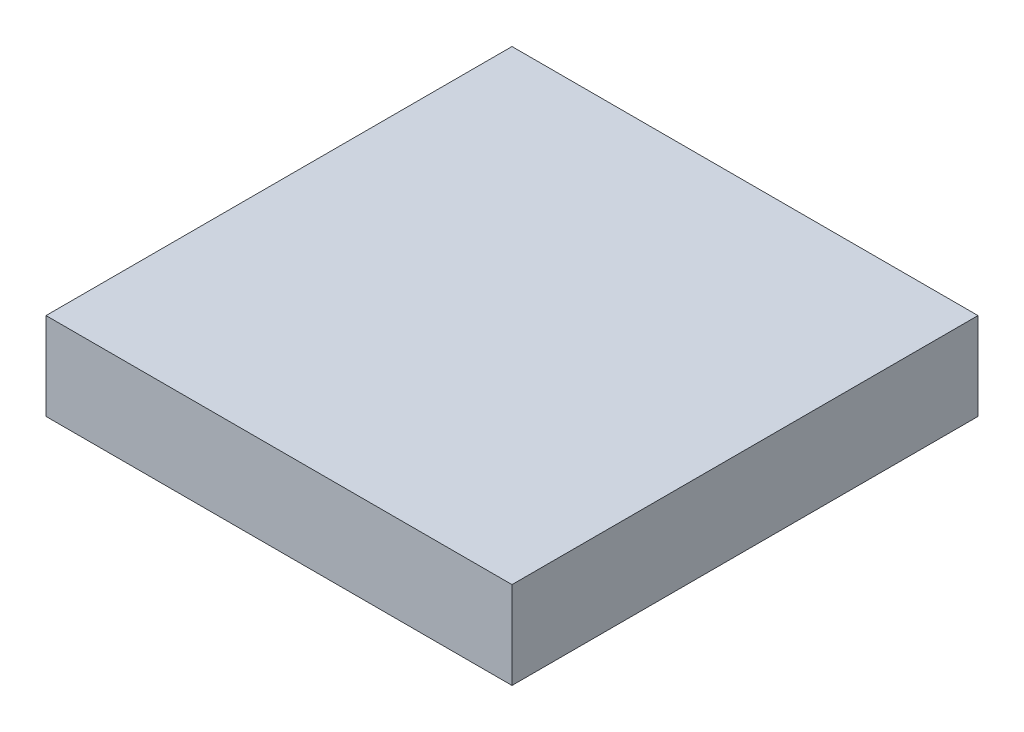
from build123d import *

# Parameters (mm, degrees)
SKETCH1_W           = 16
SKETCH1_H           = 16
BOSS_EXTRUDE1_DEPTH = 3


with BuildPart() as part:
    # Sketch1 → Boss-Extrude1 (new body)
    with BuildSketch(Plane(origin=(0, 0, 0), x_dir=(1, 0, 0), z_dir=(0, 1, 0))):
        with Locations((8, -8)):
            Rectangle(SKETCH1_W, SKETCH1_H)
    extrude(amount=BOSS_EXTRUDE1_DEPTH)


solid = part.part
